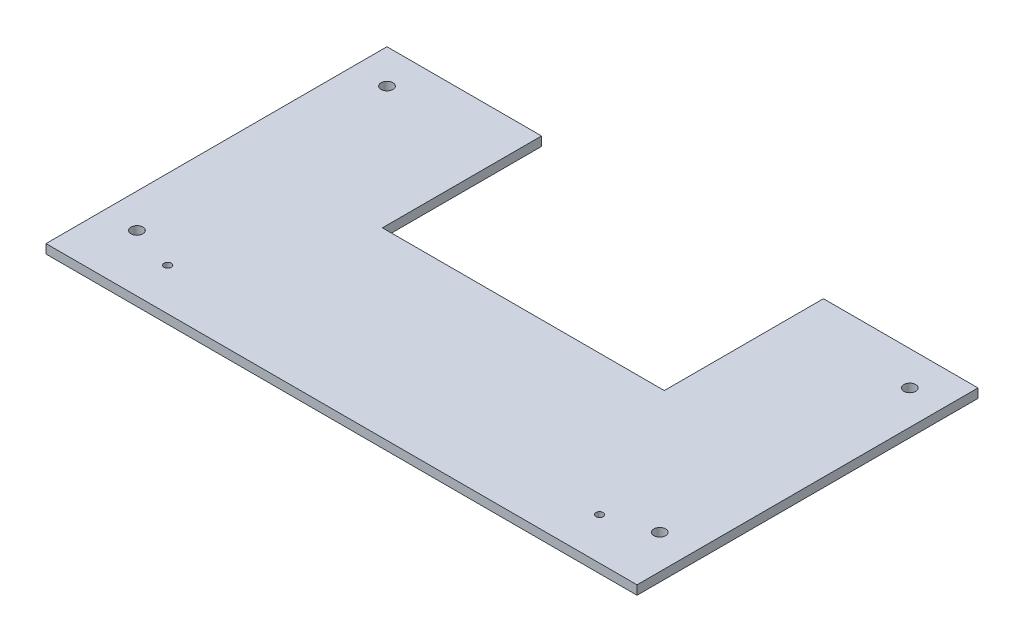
from build123d import *

# Parameters (mm, degrees)
CROQUIS1_W              = 260
CROQUIS1_H              = 150
SALIENTE_EXTRUIR1_DEPTH = 4
CROQUIS2_R              = 2.6
CROQUIS2_W              = 124
CROQUIS2_H              = 70
CORTAR_EXTRUIR1_DEPTH   = 4
CROQUIS3_R              = 1.6
CORTAR_EXTRUIR2_DEPTH   = 10


with BuildPart() as part:
    # Croquis1 → Saliente-Extruir1 (new body)
    with BuildSketch(Plane(origin=(0, 0, 0), x_dir=(1, 0, 0), z_dir=(0, 1, 0))):
        Rectangle(CROQUIS1_W, CROQUIS1_H)
    extrude(amount=SALIENTE_EXTRUIR1_DEPTH)

    # Croquis2 → Cortar-Extruir1 (cut)
    with BuildSketch(Plane(origin=(0, 4, 0), x_dir=(1, 0, 0), z_dir=(0, 1, 0))):
        with Locations(Location((-115, 60, 0), (0, 0, 270))):
            Circle(CROQUIS2_R)
        with Locations(Location((115, 60, 0), (0, 0, 270))):
            Circle(CROQUIS2_R)
        with Locations(Location((115, -50, 0), (0, 0, 270))):
            Circle(CROQUIS2_R)
        with Locations(Location((-115, -50, 0), (0, 0, 270))):
            Circle(CROQUIS2_R)
        with Locations((0, 40)):
            Rectangle(CROQUIS2_W, CROQUIS2_H)
    extrude(amount=-CORTAR_EXTRUIR1_DEPTH, mode=Mode.SUBTRACT)

    # Croquis3 → Cortar-Extruir2 (cut)
    with BuildSketch(Plane(origin=(0, 4, 0), x_dir=(1, 0, 0), z_dir=(0, 1, 0))):
        with Locations(Location((95, -56.5, 0), (0, 0, 270))):
            Circle(CROQUIS3_R)
        with Locations(Location((-95, -56.5, 0), (0, 0, 270))):
            Circle(CROQUIS3_R)
    extrude(amount=-CORTAR_EXTRUIR2_DEPTH, mode=Mode.SUBTRACT)


solid = part.part
